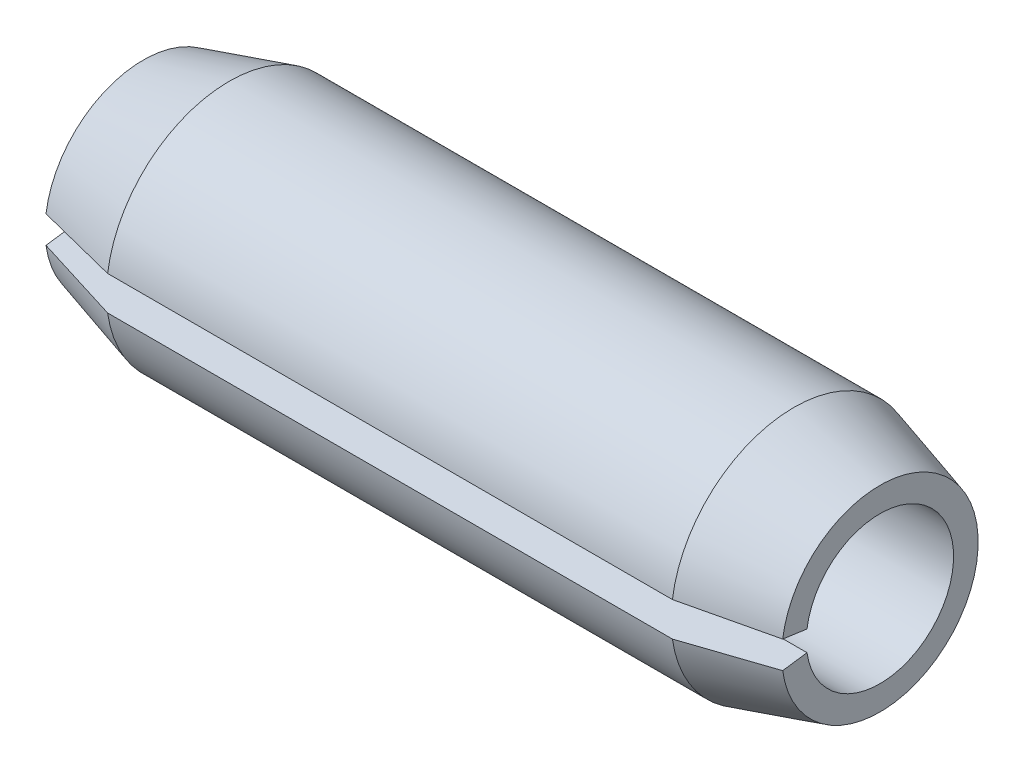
from build123d import *

# Parameters (mm, degrees)
SKETCH1_R          = 0.5
SKETCH1_R_2        = 0.4
BASE_EXTRUDE_DEPTH = 3
SKETCH2_R          = 0.4
SKETCH2_R_2        = 0.3
EXTRUDE2_DEPTH     = 3
GAP_DEPTH          = 4.082207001


with BuildPart() as part:
    # Sketch1 → Base-Extrude (new body)
    with BuildSketch(Plane(origin=(0, 0, 0), x_dir=(0, 0, -1), z_dir=(1, 0, 0))):
        Circle(SKETCH1_R)
        Circle(SKETCH1_R_2, mode=Mode.SUBTRACT)
    extrude(amount=BASE_EXTRUDE_DEPTH)

    # Sketch2 → Extrude2 (add)
    with BuildSketch(Plane(origin=(0, 0, 0), x_dir=(0, 0, -1), z_dir=(1, 0, 0))):
        Circle(SKETCH2_R)
        Circle(SKETCH2_R_2, mode=Mode.SUBTRACT)
    extrude(amount=EXTRUDE2_DEPTH)

    # Sketch3 → Cut-Revolve1 (revolve, cut)
    with BuildSketch(Plane.XY, mode=Mode.PRIVATE) as cut_revolve1_sk:
        Polygon((3, 0.5), (3, 0.4), (2.65, 0.5), align=None)
        Polygon((0.35, 0.5), (0, 0.4), (0, 0.5), align=None)
    revolve(cut_revolve1_sk.sketch.rotate(Axis((1.5, 0, 0), (1, 0, 0)), 90), axis=Axis((1.5, 0, 0), (1, 0, 0)), mode=Mode.SUBTRACT)

    # Sketch4 → Gap (cut, through all)
    with BuildSketch(Plane(origin=(0, 0, 0), x_dir=(0, 0, -1), z_dir=(1, 0, 0))):
        Polygon((0, 0), (-0.6, 0.084324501), (-0.6, -0.084324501), align=None)
    extrude(amount=GAP_DEPTH, mode=Mode.SUBTRACT)


solid = part.part
